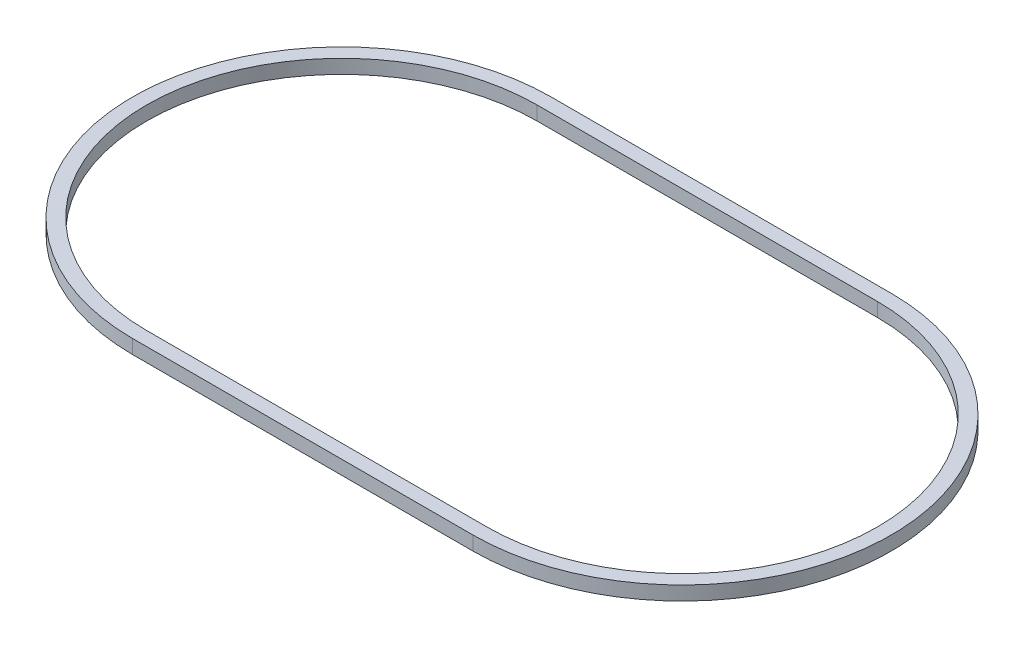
from build123d import *

# Parameters (mm, degrees)
BOSS_EXTRUDE1_DEPTH = 2.5


with BuildPart() as part:
    # Sketch1 → Boss-Extrude1 (new body)
    with BuildSketch(Plane(origin=(0, 0, 0), x_dir=(1, 0, 0), z_dir=(0, 1, 0))):
        with BuildLine():
            Line((30.5, -37.5), (-30.5, -37.5))
            ThreePointArc((-30.5, -37.5), (-68, 0), (-30.5, 37.5))
            Line((-30.5, 37.5), (30.5, 37.5))
            ThreePointArc((30.5, 37.5), (68, 0), (30.5, -37.5))
        make_face()
        with BuildLine():
            Line((30.5, -35), (-30.5, -35))
            ThreePointArc((-30.5, -35), (-65.5, 0), (-30.5, 35))
            Line((-30.5, 35), (30.5, 35))
            ThreePointArc((30.5, 35), (65.5, 0), (30.5, -35))
        make_face(mode=Mode.SUBTRACT)
    extrude(amount=BOSS_EXTRUDE1_DEPTH)


solid = part.part
